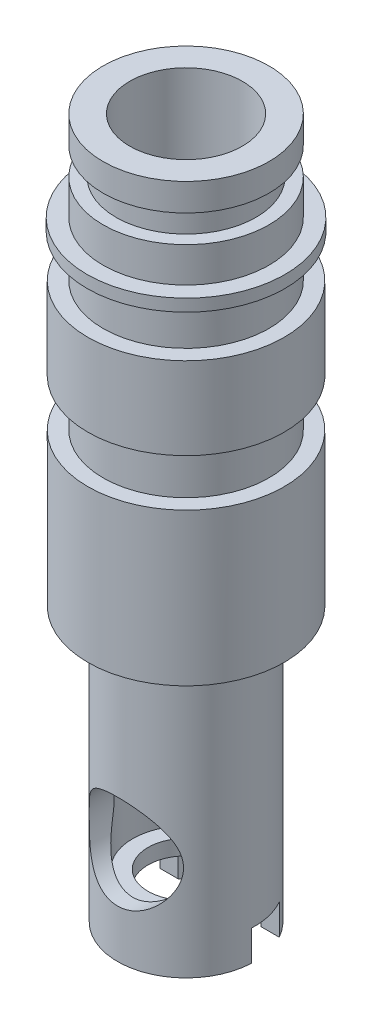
from build123d import *

# Parameters (mm, degrees)
SKETCH3_W                        = 1.0795
SKETCH3_H                        = 2.286
SKETCH4_W                        = 1.3335
SKETCH4_H                        = 1.016
SKETCH6_R                        = 3.937
AIR_OUT_2_MOUTHPIECE_DEPTH       = 60.575048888
SKETCH7_R                        = 2.3495
AIR_OUT_2_BC_DEPTH               = 60.575048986
SKETCH8_R                        = 1.27
VENT_DEPTH                       = 60.575048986
SLOT_FOR_DEMAND_LEVER_DEPTH      = 60.575048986
SLOT_FOR_DEMAND_LEVER_DEPTH_BACK = 60.575048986
SKETCH9_W                        = 3.048
SKETCH9_H                        = 2.54
SKETCH10_W                       = 16.383
SKETCH10_H                       = 2.4765
CLOCKING_CUT_DEPTH               = 2.54
SKETCH11_R                       = 4.445
SKETCH11_R_2                     = 3.175
SPRING_REST_DEPTH                = 1.27


with BuildPart() as part:
    # Sketch2 → Main Shaft (revolve)
    with BuildSketch(Plane.XY, mode=Mode.PRIVATE) as main_shaft_sk:
        Polygon((0, 0), (6.9215, 0), (6.9215, -12.065), (8.1915, -12.065), (8.1915, -18.923), (6.9215, -18.923), (6.9215, -22.86), (8.1915, -22.86), (8.1915, -35.56), (5.715, -35.56), (5.715, -58.42), (0, -58.42), align=None)
    revolve(main_shaft_sk.sketch.rotate(Axis((0, 0, 0), (0, -1, 0)), 90), axis=Axis((0, 0, 0), (0, -1, 0)))

    # Sketch3 → Top Groove (revolve, cut)
    with BuildSketch(Plane.XY, mode=Mode.PRIVATE) as top_groove_sk:
        with Locations((6.38175, -3.429)):
            Rectangle(SKETCH3_W, SKETCH3_H)
    revolve(top_groove_sk.sketch.rotate(Axis((0, 0, 0), (0, -1, 0)), 90), axis=Axis((0, 0, 0), (0, -1, 0)), mode=Mode.SUBTRACT)

    # Sketch4 → Upper Flange (revolve)
    with BuildSketch(Plane.XY, mode=Mode.PRIVATE) as upper_flange_sk:
        with Locations((7.58825, -8.001)):
            Rectangle(SKETCH4_W, SKETCH4_H)
    revolve(upper_flange_sk.sketch.rotate(Axis((0, 0, 0), (0, -1, 0)), 90), axis=Axis((0, 0, 0), (0, -1, 0)))

    # Sketch5 → ID 2 (revolve, cut)
    with BuildSketch(Plane.XY, mode=Mode.PRIVATE) as id_2_sk:
        Polygon((0, 0), (4.699, 0), (4.699, -23.359316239), (4.445, -23.359316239), (4.445, -58.42), (0, -58.42), align=None)
    revolve(id_2_sk.sketch.rotate(Axis((0, 0, 0), (0, -1, 0)), 90), axis=Axis((0, 0, 0), (0, -1, 0)), mode=Mode.SUBTRACT)

    # Sketch6 → Air Out 2 Mouthpiece (cut, through all)
    with BuildSketch(Plane.XY):
        with Locations(Location((0, -50.4698, 0), (0, 0, 270))):
            Circle(SKETCH6_R)
    extrude(amount=AIR_OUT_2_MOUTHPIECE_DEPTH, mode=Mode.SUBTRACT)

    # Sketch7 → Air Out 2 BC (cut, through all)
    with BuildSketch(Plane.XY):
        with Locations((0, -15.3416)):
            Circle(SKETCH7_R)
    extrude(amount=-AIR_OUT_2_BC_DEPTH, mode=Mode.SUBTRACT)

    # Sketch8 → Vent (cut, through all)
    with BuildSketch(Plane.XY):
        with Locations((0, -49.53)):
            Circle(SKETCH8_R)
    extrude(amount=-VENT_DEPTH, mode=Mode.SUBTRACT)

    # Sketch9 → Slot for Demand Lever (cut, two sides: drawn at the far end of the back side and taken through both)
    with BuildSketch(Plane(origin=(0, 0, 0), x_dir=(0, 0, -1), z_dir=(1, 0, 0)).offset(-SLOT_FOR_DEMAND_LEVER_DEPTH_BACK)):
        with Locations((1.27, -57.15)):
            Rectangle(SKETCH9_W, SKETCH9_H)
    extrude(amount=SLOT_FOR_DEMAND_LEVER_DEPTH + SLOT_FOR_DEMAND_LEVER_DEPTH_BACK, mode=Mode.SUBTRACT)

    # Sketch10 → Clocking cut (cut)
    with BuildSketch(Plane.XZ.offset(35.56)):
        with Locations((0, -6.95325)):
            Rectangle(SKETCH10_W, SKETCH10_H)
    extrude(amount=-CLOCKING_CUT_DEPTH, mode=Mode.SUBTRACT)

    # Sketch11 → Spring Rest (add)
    with BuildSketch(Plane.XZ.offset(55.88)):
        with Locations(Location((0, 0, 0), (0, 0, 90))):
            Circle(SKETCH11_R)
        with Locations(Location((0, 0, 0), (0, 0, 270))):
            Circle(SKETCH11_R_2, mode=Mode.SUBTRACT)
    extrude(amount=-SPRING_REST_DEPTH)


solid = part.part
